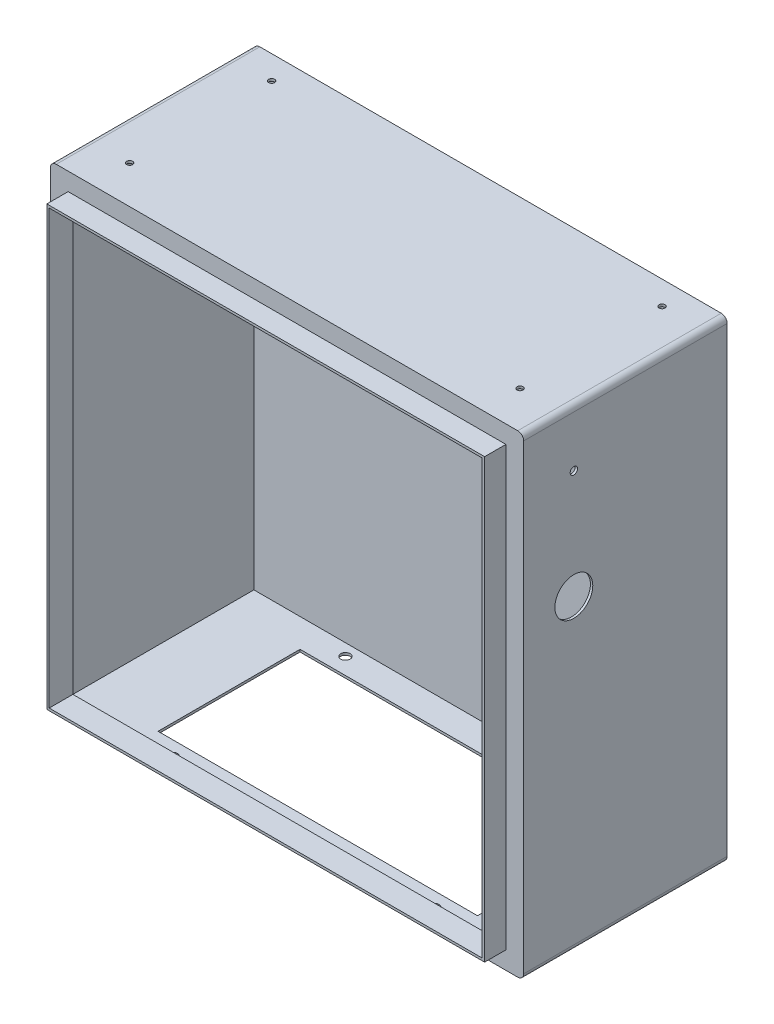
ISO-10303-21;
HEADER;
FILE_DESCRIPTION(('STEP AP214'),'2;1');
FILE_NAME('part.step','',(''),(''),'','','');
FILE_SCHEMA(('AUTOMOTIVE_DESIGN { 1 0 10303 214 1 1 1 1 }'));
ENDSEC;
DATA;
#1=APPLICATION_CONTEXT('core data for automotive mechanical design processes');
#2=APPLICATION_PROTOCOL_DEFINITION('international standard','automotive_design',2000,#1);
#3=PRODUCT_CONTEXT('',#1,'mechanical');
#4=PRODUCT('Part','Part','',(#3));
#5=PRODUCT_RELATED_PRODUCT_CATEGORY('part','',(#4));
#6=PRODUCT_DEFINITION_FORMATION('','',#4);
#7=PRODUCT_DEFINITION_CONTEXT('part definition',#1,'design');
#8=PRODUCT_DEFINITION('design','',#6,#7);
#9=PRODUCT_DEFINITION_SHAPE('','',#8);
#10=(LENGTH_UNIT() NAMED_UNIT(*) SI_UNIT(.MILLI.,.METRE.));
#11=(NAMED_UNIT(*) PLANE_ANGLE_UNIT() SI_UNIT($,.RADIAN.));
#12=(NAMED_UNIT(*) SI_UNIT($,.STERADIAN.) SOLID_ANGLE_UNIT());
#13=UNCERTAINTY_MEASURE_WITH_UNIT(LENGTH_MEASURE(1.E-05),#10,'distance_accuracy_value','');
#14=(GEOMETRIC_REPRESENTATION_CONTEXT(3) GLOBAL_UNCERTAINTY_ASSIGNED_CONTEXT((#13)) GLOBAL_UNIT_ASSIGNED_CONTEXT((#10,
#11,#12)) REPRESENTATION_CONTEXT('',''));
#15=CARTESIAN_POINT('',(0.,0.,0.));
#16=DIRECTION('',(0.,0.,1.));
#17=DIRECTION('',(1.,0.,0.));
#18=AXIS2_PLACEMENT_3D('',#15,#16,#17);
#19=CARTESIAN_POINT('',(0.,0.,170.));
#20=DIRECTION('',(1.,0.,0.));
#21=DIRECTION('',(0.,0.,-1.));
#22=AXIS2_PLACEMENT_3D('',#19,#20,#21);
#23=PLANE('',#22);
#24=DIRECTION('',(0.,-1.,0.));
#25=VECTOR('',#24,1.);
#26=CARTESIAN_POINT('',(0.,400.,172.));
#27=LINE('',#26,#25);
#28=CARTESIAN_POINT('',(0.,395.,172.));
#29=VERTEX_POINT('',#28);
#30=CARTESIAN_POINT('',(0.,5.,172.));
#31=VERTEX_POINT('',#30);
#32=EDGE_CURVE('E342',#29,#31,#27,.T.);
#33=ORIENTED_EDGE('',*,*,#32,.F.);
#34=DIRECTION('',(0.,0.,-1.));
#35=VECTOR('',#34,1.);
#36=CARTESIAN_POINT('',(0.,395.,170.));
#37=LINE('',#36,#35);
#38=CARTESIAN_POINT('',(0.,395.,0.));
#39=VERTEX_POINT('',#38);
#40=EDGE_CURVE('E459',#29,#39,#37,.T.);
#41=ORIENTED_EDGE('',*,*,#40,.T.);
#42=DIRECTION('',(0.,-1.,0.));
#43=VECTOR('',#42,1.);
#44=CARTESIAN_POINT('',(0.,0.,0.));
#45=LINE('',#44,#43);
#46=CARTESIAN_POINT('',(0.,5.,0.));
#47=VERTEX_POINT('',#46);
#48=EDGE_CURVE('E359',#39,#47,#45,.T.);
#49=ORIENTED_EDGE('',*,*,#48,.T.);
#50=DIRECTION('',(0.,0.,-1.));
#51=VECTOR('',#50,1.);
#52=CARTESIAN_POINT('',(0.,5.,170.));
#53=LINE('',#52,#51);
#54=EDGE_CURVE('E456',#47,#31,#53,.F.);
#55=ORIENTED_EDGE('',*,*,#54,.T.);
#56=EDGE_LOOP('',(#33,#41,#49,#55));
#57=FACE_BOUND('',#56,.T.);
#58=ADVANCED_FACE('F48',(#57),#23,.F.);
#59=CARTESIAN_POINT('',(0.,0.,170.));
#60=DIRECTION('',(0.,1.,0.));
#61=DIRECTION('',(0.,0.,1.));
#62=AXIS2_PLACEMENT_3D('',#59,#60,#61);
#63=PLANE('',#62);
#64=CARTESIAN_POINT('',(89.37,0.,12.));
#65=DIRECTION('',(0.,-1.,0.));
#66=DIRECTION('',(0.,0.,-1.));
#67=AXIS2_PLACEMENT_3D('',#64,#65,#66);
#68=CIRCLE('',#67,3.99999999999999);
#69=CARTESIAN_POINT('',(89.37,0.,7.99999999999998));
#70=VERTEX_POINT('',#69);
#71=EDGE_CURVE('E507',#70,#70,#68,.T.);
#72=ORIENTED_EDGE('',*,*,#71,.F.);
#73=EDGE_LOOP('',(#72));
#74=FACE_BOUND('',#73,.T.);
#75=CARTESIAN_POINT('',(310.63,0.,158.));
#76=DIRECTION('',(0.,-1.,0.));
#77=DIRECTION('',(0.,0.,-1.));
#78=AXIS2_PLACEMENT_3D('',#75,#76,#77);
#79=CIRCLE('',#78,3.99999999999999);
#80=CARTESIAN_POINT('',(310.63,0.,154.));
#81=VERTEX_POINT('',#80);
#82=EDGE_CURVE('E514',#81,#81,#79,.T.);
#83=ORIENTED_EDGE('',*,*,#82,.F.);
#84=EDGE_LOOP('',(#83));
#85=FACE_BOUND('',#84,.T.);
#86=CARTESIAN_POINT('',(89.37,0.,158.));
#87=DIRECTION('',(0.,-1.,0.));
#88=DIRECTION('',(0.,0.,-1.));
#89=AXIS2_PLACEMENT_3D('',#86,#87,#88);
#90=CIRCLE('',#89,3.99999999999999);
#91=CARTESIAN_POINT('',(89.37,0.,154.));
#92=VERTEX_POINT('',#91);
#93=EDGE_CURVE('E525',#92,#92,#90,.T.);
#94=ORIENTED_EDGE('',*,*,#93,.F.);
#95=EDGE_LOOP('',(#94));
#96=FACE_BOUND('',#95,.T.);
#97=CARTESIAN_POINT('',(310.63,0.,12.));
#98=DIRECTION('',(0.,-1.,0.));
#99=DIRECTION('',(0.,0.,-1.));
#100=AXIS2_PLACEMENT_3D('',#97,#98,#99);
#101=CIRCLE('',#100,3.99999999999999);
#102=CARTESIAN_POINT('',(310.63,0.,8.00000000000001));
#103=VERTEX_POINT('',#102);
#104=EDGE_CURVE('E492',#103,#103,#101,.T.);
#105=ORIENTED_EDGE('',*,*,#104,.F.);
#106=EDGE_LOOP('',(#105));
#107=FACE_BOUND('',#106,.T.);
#108=DIRECTION('',(1.,0.,0.));
#109=VECTOR('',#108,1.);
#110=CARTESIAN_POINT('',(65.,0.,26.));
#111=LINE('',#110,#109);
#112=CARTESIAN_POINT('',(65.,0.,26.));
#113=VERTEX_POINT('',#112);
#114=CARTESIAN_POINT('',(335.,0.,26.));
#115=VERTEX_POINT('',#114);
#116=EDGE_CURVE('E224',#113,#115,#111,.T.);
#117=ORIENTED_EDGE('',*,*,#116,.F.);
#118=DIRECTION('',(0.,0.,-1.));
#119=VECTOR('',#118,1.);
#120=CARTESIAN_POINT('',(65.,0.,146.));
#121=LINE('',#120,#119);
#122=CARTESIAN_POINT('',(65.,0.,146.));
#123=VERTEX_POINT('',#122);
#124=EDGE_CURVE('E66',#123,#113,#121,.T.);
#125=ORIENTED_EDGE('',*,*,#124,.F.);
#126=DIRECTION('',(-1.,0.,0.));
#127=VECTOR('',#126,1.);
#128=CARTESIAN_POINT('',(65.,0.,146.));
#129=LINE('',#128,#127);
#130=CARTESIAN_POINT('',(335.,0.,146.));
#131=VERTEX_POINT('',#130);
#132=EDGE_CURVE('E232',#131,#123,#129,.T.);
#133=ORIENTED_EDGE('',*,*,#132,.F.);
#134=DIRECTION('',(0.,0.,1.));
#135=VECTOR('',#134,1.);
#136=CARTESIAN_POINT('',(335.,0.,146.));
#137=LINE('',#136,#135);
#138=EDGE_CURVE('E214',#115,#131,#137,.T.);
#139=ORIENTED_EDGE('',*,*,#138,.F.);
#140=EDGE_LOOP('',(#117,#125,#133,#139));
#141=FACE_BOUND('',#140,.T.);
#142=DIRECTION('',(1.,0.,0.));
#143=VECTOR('',#142,1.);
#144=CARTESIAN_POINT('',(0.,0.,0.));
#145=LINE('',#144,#143);
#146=CARTESIAN_POINT('',(5.,0.,0.));
#147=VERTEX_POINT('',#146);
#148=CARTESIAN_POINT('',(395.,0.,0.));
#149=VERTEX_POINT('',#148);
#150=EDGE_CURVE('E399',#147,#149,#145,.T.);
#151=ORIENTED_EDGE('',*,*,#150,.T.);
#152=DIRECTION('',(0.,0.,-1.));
#153=VECTOR('',#152,1.);
#154=CARTESIAN_POINT('',(395.,0.,170.));
#155=LINE('',#154,#153);
#156=CARTESIAN_POINT('',(395.,0.,172.));
#157=VERTEX_POINT('',#156);
#158=EDGE_CURVE('E453',#149,#157,#155,.F.);
#159=ORIENTED_EDGE('',*,*,#158,.T.);
#160=DIRECTION('',(1.,0.,0.));
#161=VECTOR('',#160,1.);
#162=CARTESIAN_POINT('',(0.,0.,172.));
#163=LINE('',#162,#161);
#164=CARTESIAN_POINT('',(5.,0.,172.));
#165=VERTEX_POINT('',#164);
#166=EDGE_CURVE('E346',#165,#157,#163,.T.);
#167=ORIENTED_EDGE('',*,*,#166,.F.);
#168=DIRECTION('',(0.,0.,-1.));
#169=VECTOR('',#168,1.);
#170=CARTESIAN_POINT('',(5.,0.,170.));
#171=LINE('',#170,#169);
#172=EDGE_CURVE('E449',#165,#147,#171,.T.);
#173=ORIENTED_EDGE('',*,*,#172,.T.);
#174=EDGE_LOOP('',(#151,#159,#167,#173));
#175=FACE_BOUND('',#174,.T.);
#176=ADVANCED_FACE('F229',(#74,#85,#96,#107,#141,#175),#63,.F.);
#177=CARTESIAN_POINT('',(400.,0.,170.));
#178=DIRECTION('',(-1.,0.,0.));
#179=DIRECTION('',(0.,0.,1.));
#180=AXIS2_PLACEMENT_3D('',#177,#178,#179);
#181=PLANE('',#180);
#182=CARTESIAN_POINT('',(400.,352.,129.589298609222));
#183=DIRECTION('',(1.,0.,0.));
#184=DIRECTION('',(0.,0.,-1.));
#185=AXIS2_PLACEMENT_3D('',#182,#183,#184);
#186=CIRCLE('',#185,3.09999999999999);
#187=CARTESIAN_POINT('',(400.,352.,126.489298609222));
#188=VERTEX_POINT('',#187);
#189=EDGE_CURVE('E522',#188,#188,#186,.T.);
#190=ORIENTED_EDGE('',*,*,#189,.F.);
#191=EDGE_LOOP('',(#190));
#192=FACE_BOUND('',#191,.T.);
#193=CARTESIAN_POINT('',(400.,260.,129.589298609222));
#194=DIRECTION('',(1.,0.,0.));
#195=DIRECTION('',(0.,0.,-1.));
#196=AXIS2_PLACEMENT_3D('',#193,#194,#195);
#197=CIRCLE('',#196,16.);
#198=CARTESIAN_POINT('',(400.,260.,113.589298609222));
#199=VERTEX_POINT('',#198);
#200=EDGE_CURVE('E508',#199,#199,#197,.T.);
#201=ORIENTED_EDGE('',*,*,#200,.F.);
#202=EDGE_LOOP('',(#201));
#203=FACE_BOUND('',#202,.T.);
#204=DIRECTION('',(0.,1.,0.));
#205=VECTOR('',#204,1.);
#206=CARTESIAN_POINT('',(400.,0.,0.));
#207=LINE('',#206,#205);
#208=CARTESIAN_POINT('',(400.,5.,0.));
#209=VERTEX_POINT('',#208);
#210=CARTESIAN_POINT('',(400.,395.,0.));
#211=VERTEX_POINT('',#210);
#212=EDGE_CURVE('E403',#209,#211,#207,.T.);
#213=ORIENTED_EDGE('',*,*,#212,.T.);
#214=DIRECTION('',(0.,0.,-1.));
#215=VECTOR('',#214,1.);
#216=CARTESIAN_POINT('',(400.,395.,170.));
#217=LINE('',#216,#215);
#218=CARTESIAN_POINT('',(400.,395.,172.));
#219=VERTEX_POINT('',#218);
#220=EDGE_CURVE('E434',#211,#219,#217,.F.);
#221=ORIENTED_EDGE('',*,*,#220,.T.);
#222=DIRECTION('',(0.,1.,0.));
#223=VECTOR('',#222,1.);
#224=CARTESIAN_POINT('',(400.,0.,172.));
#225=LINE('',#224,#223);
#226=CARTESIAN_POINT('',(400.,5.,172.));
#227=VERTEX_POINT('',#226);
#228=EDGE_CURVE('E334',#227,#219,#225,.T.);
#229=ORIENTED_EDGE('',*,*,#228,.F.);
#230=DIRECTION('',(0.,0.,-1.));
#231=VECTOR('',#230,1.);
#232=CARTESIAN_POINT('',(400.,5.,170.));
#233=LINE('',#232,#231);
#234=EDGE_CURVE('E430',#227,#209,#233,.T.);
#235=ORIENTED_EDGE('',*,*,#234,.T.);
#236=EDGE_LOOP('',(#213,#221,#229,#235));
#237=FACE_BOUND('',#236,.T.);
#238=ADVANCED_FACE('F557',(#192,#203,#237),#181,.F.);
#239=CARTESIAN_POINT('',(0.,400.,170.));
#240=DIRECTION('',(0.,-1.,0.));
#241=DIRECTION('',(0.,0.,-1.));
#242=AXIS2_PLACEMENT_3D('',#239,#240,#241);
#243=PLANE('',#242);
#244=CARTESIAN_POINT('',(35.0000000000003,400.,140.));
#245=DIRECTION('',(0.,1.,0.));
#246=DIRECTION('',(0.,0.,1.));
#247=AXIS2_PLACEMENT_3D('',#244,#245,#246);
#248=CIRCLE('',#247,2.5);
#249=CARTESIAN_POINT('',(35.0000000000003,400.,142.5));
#250=VERTEX_POINT('',#249);
#251=EDGE_CURVE('E503',#250,#250,#248,.T.);
#252=ORIENTED_EDGE('',*,*,#251,.F.);
#253=EDGE_LOOP('',(#252));
#254=FACE_BOUND('',#253,.T.);
#255=CARTESIAN_POINT('',(365.,400.,19.9999999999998));
#256=DIRECTION('',(0.,1.,0.));
#257=DIRECTION('',(0.,0.,1.));
#258=AXIS2_PLACEMENT_3D('',#255,#256,#257);
#259=CIRCLE('',#258,2.50000000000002);
#260=CARTESIAN_POINT('',(365.,400.,22.4999999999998));
#261=VERTEX_POINT('',#260);
#262=EDGE_CURVE('E539',#261,#261,#259,.T.);
#263=ORIENTED_EDGE('',*,*,#262,.F.);
#264=EDGE_LOOP('',(#263));
#265=FACE_BOUND('',#264,.T.);
#266=CARTESIAN_POINT('',(365.,400.,140.));
#267=DIRECTION('',(0.,1.,0.));
#268=DIRECTION('',(0.,0.,1.));
#269=AXIS2_PLACEMENT_3D('',#266,#267,#268);
#270=CIRCLE('',#269,2.50000000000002);
#271=CARTESIAN_POINT('',(365.,400.,142.5));
#272=VERTEX_POINT('',#271);
#273=EDGE_CURVE('E535',#272,#272,#270,.T.);
#274=ORIENTED_EDGE('',*,*,#273,.F.);
#275=EDGE_LOOP('',(#274));
#276=FACE_BOUND('',#275,.T.);
#277=CARTESIAN_POINT('',(35.0000000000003,400.,19.9999999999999));
#278=DIRECTION('',(0.,1.,0.));
#279=DIRECTION('',(0.,0.,1.));
#280=AXIS2_PLACEMENT_3D('',#277,#278,#279);
#281=CIRCLE('',#280,2.5);
#282=CARTESIAN_POINT('',(35.0000000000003,400.,22.4999999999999));
#283=VERTEX_POINT('',#282);
#284=EDGE_CURVE('E475',#283,#283,#281,.T.);
#285=ORIENTED_EDGE('',*,*,#284,.F.);
#286=EDGE_LOOP('',(#285));
#287=FACE_BOUND('',#286,.T.);
#288=DIRECTION('',(-1.,0.,0.));
#289=VECTOR('',#288,1.);
#290=CARTESIAN_POINT('',(400.,400.,172.));
#291=LINE('',#290,#289);
#292=CARTESIAN_POINT('',(395.,400.,172.));
#293=VERTEX_POINT('',#292);
#294=CARTESIAN_POINT('',(5.,400.,172.));
#295=VERTEX_POINT('',#294);
#296=EDGE_CURVE('E338',#293,#295,#291,.T.);
#297=ORIENTED_EDGE('',*,*,#296,.F.);
#298=DIRECTION('',(0.,0.,-1.));
#299=VECTOR('',#298,1.);
#300=CARTESIAN_POINT('',(395.,400.,170.));
#301=LINE('',#300,#299);
#302=CARTESIAN_POINT('',(395.,400.,0.));
#303=VERTEX_POINT('',#302);
#304=EDGE_CURVE('E414',#293,#303,#301,.T.);
#305=ORIENTED_EDGE('',*,*,#304,.T.);
#306=DIRECTION('',(-1.,0.,0.));
#307=VECTOR('',#306,1.);
#308=CARTESIAN_POINT('',(0.,400.,0.));
#309=LINE('',#308,#307);
#310=CARTESIAN_POINT('',(5.,400.,0.));
#311=VERTEX_POINT('',#310);
#312=EDGE_CURVE('E407',#303,#311,#309,.T.);
#313=ORIENTED_EDGE('',*,*,#312,.T.);
#314=DIRECTION('',(0.,0.,-1.));
#315=VECTOR('',#314,1.);
#316=CARTESIAN_POINT('',(5.,400.,170.));
#317=LINE('',#316,#315);
#318=EDGE_CURVE('E411',#311,#295,#317,.F.);
#319=ORIENTED_EDGE('',*,*,#318,.T.);
#320=EDGE_LOOP('',(#297,#305,#313,#319));
#321=FACE_BOUND('',#320,.T.);
#322=ADVANCED_FACE('F553',(#254,#265,#276,#287,#321),#243,.F.);
#323=CARTESIAN_POINT('',(0.,0.,0.));
#324=DIRECTION('',(0.,0.,-1.));
#325=DIRECTION('',(-1.,0.,0.));
#326=AXIS2_PLACEMENT_3D('',#323,#324,#325);
#327=PLANE('',#326);
#328=ORIENTED_EDGE('',*,*,#312,.F.);
#329=CARTESIAN_POINT('',(395.,395.,0.));
#330=DIRECTION('',(0.,0.,-1.));
#331=DIRECTION('',(-1.,0.,0.));
#332=AXIS2_PLACEMENT_3D('',#329,#330,#331);
#333=CIRCLE('',#332,5.);
#334=EDGE_CURVE('E427',#303,#211,#333,.T.);
#335=ORIENTED_EDGE('',*,*,#334,.T.);
#336=ORIENTED_EDGE('',*,*,#212,.F.);
#337=CARTESIAN_POINT('',(395.,5.,0.));
#338=DIRECTION('',(0.,0.,-1.));
#339=DIRECTION('',(-1.,0.,0.));
#340=AXIS2_PLACEMENT_3D('',#337,#338,#339);
#341=CIRCLE('',#340,5.);
#342=EDGE_CURVE('E424',#209,#149,#341,.T.);
#343=ORIENTED_EDGE('',*,*,#342,.T.);
#344=ORIENTED_EDGE('',*,*,#150,.F.);
#345=CARTESIAN_POINT('',(5.,5.,0.));
#346=DIRECTION('',(0.,0.,-1.));
#347=DIRECTION('',(-1.,0.,0.));
#348=AXIS2_PLACEMENT_3D('',#345,#346,#347);
#349=CIRCLE('',#348,5.);
#350=EDGE_CURVE('E418',#147,#47,#349,.T.);
#351=ORIENTED_EDGE('',*,*,#350,.T.);
#352=ORIENTED_EDGE('',*,*,#48,.F.);
#353=CARTESIAN_POINT('',(5.,395.,0.));
#354=DIRECTION('',(0.,0.,-1.));
#355=DIRECTION('',(-1.,0.,0.));
#356=AXIS2_PLACEMENT_3D('',#353,#354,#355);
#357=CIRCLE('',#356,5.);
#358=EDGE_CURVE('E421',#39,#311,#357,.T.);
#359=ORIENTED_EDGE('',*,*,#358,.T.);
#360=EDGE_LOOP('',(#328,#335,#336,#343,#344,#351,#352,#359));
#361=FACE_BOUND('',#360,.T.);
#362=ADVANCED_FACE('F556',(#361),#327,.T.);
#363=CARTESIAN_POINT('',(0.,0.,172.));
#364=DIRECTION('',(0.,0.,1.));
#365=DIRECTION('',(1.,0.,0.));
#366=AXIS2_PLACEMENT_3D('',#363,#364,#365);
#367=PLANE('',#366);
#368=ORIENTED_EDGE('',*,*,#228,.T.);
#369=CARTESIAN_POINT('',(395.,395.,172.));
#370=DIRECTION('',(0.,0.,1.));
#371=DIRECTION('',(1.,0.,0.));
#372=AXIS2_PLACEMENT_3D('',#369,#370,#371);
#373=CIRCLE('',#372,5.);
#374=EDGE_CURVE('E446',#219,#293,#373,.T.);
#375=ORIENTED_EDGE('',*,*,#374,.T.);
#376=ORIENTED_EDGE('',*,*,#296,.T.);
#377=CARTESIAN_POINT('',(5.,395.,172.));
#378=DIRECTION('',(0.,0.,1.));
#379=DIRECTION('',(1.,0.,0.));
#380=AXIS2_PLACEMENT_3D('',#377,#378,#379);
#381=CIRCLE('',#380,5.);
#382=EDGE_CURVE('E440',#295,#29,#381,.T.);
#383=ORIENTED_EDGE('',*,*,#382,.T.);
#384=ORIENTED_EDGE('',*,*,#32,.T.);
#385=CARTESIAN_POINT('',(5.,5.,172.));
#386=DIRECTION('',(0.,0.,1.));
#387=DIRECTION('',(1.,0.,0.));
#388=AXIS2_PLACEMENT_3D('',#385,#386,#387);
#389=CIRCLE('',#388,5.);
#390=EDGE_CURVE('E437',#31,#165,#389,.T.);
#391=ORIENTED_EDGE('',*,*,#390,.T.);
#392=ORIENTED_EDGE('',*,*,#166,.T.);
#393=CARTESIAN_POINT('',(395.,5.,172.));
#394=DIRECTION('',(0.,0.,1.));
#395=DIRECTION('',(1.,0.,0.));
#396=AXIS2_PLACEMENT_3D('',#393,#394,#395);
#397=CIRCLE('',#396,5.);
#398=EDGE_CURVE('E443',#157,#227,#397,.T.);
#399=ORIENTED_EDGE('',*,*,#398,.T.);
#400=EDGE_LOOP('',(#368,#375,#376,#383,#384,#391,#392,#399));
#401=FACE_BOUND('',#400,.T.);
#402=DIRECTION('',(1.,0.,0.));
#403=VECTOR('',#402,1.);
#404=CARTESIAN_POINT('',(15.,15.,172.));
#405=LINE('',#404,#403);
#406=CARTESIAN_POINT('',(15.,15.,172.));
#407=VERTEX_POINT('',#406);
#408=CARTESIAN_POINT('',(385.,15.,172.));
#409=VERTEX_POINT('',#408);
#410=EDGE_CURVE('E322',#407,#409,#405,.T.);
#411=ORIENTED_EDGE('',*,*,#410,.F.);
#412=DIRECTION('',(0.,-1.,0.));
#413=VECTOR('',#412,1.);
#414=CARTESIAN_POINT('',(15.,385.,172.));
#415=LINE('',#414,#413);
#416=CARTESIAN_POINT('',(15.,385.,172.));
#417=VERTEX_POINT('',#416);
#418=EDGE_CURVE('E310',#417,#407,#415,.T.);
#419=ORIENTED_EDGE('',*,*,#418,.F.);
#420=DIRECTION('',(-1.,0.,0.));
#421=VECTOR('',#420,1.);
#422=CARTESIAN_POINT('',(15.,385.,172.));
#423=LINE('',#422,#421);
#424=CARTESIAN_POINT('',(385.,385.,172.));
#425=VERTEX_POINT('',#424);
#426=EDGE_CURVE('E330',#425,#417,#423,.T.);
#427=ORIENTED_EDGE('',*,*,#426,.F.);
#428=DIRECTION('',(0.,1.,0.));
#429=VECTOR('',#428,1.);
#430=CARTESIAN_POINT('',(385.,385.,172.));
#431=LINE('',#430,#429);
#432=EDGE_CURVE('E326',#409,#425,#431,.T.);
#433=ORIENTED_EDGE('',*,*,#432,.F.);
#434=EDGE_LOOP('',(#411,#419,#427,#433));
#435=FACE_BOUND('',#434,.T.);
#436=ADVANCED_FACE('F591',(#401,#435),#367,.T.);
#437=CARTESIAN_POINT('',(15.,385.,170.));
#438=DIRECTION('',(-1.,0.,0.));
#439=DIRECTION('',(0.,-1.,0.));
#440=AXIS2_PLACEMENT_3D('',#437,#438,#439);
#441=PLANE('',#440);
#442=DIRECTION('',(0.,0.,1.));
#443=VECTOR('',#442,1.);
#444=CARTESIAN_POINT('',(15.,385.,170.));
#445=LINE('',#444,#443);
#446=CARTESIAN_POINT('',(15.,385.,190.));
#447=VERTEX_POINT('',#446);
#448=EDGE_CURVE('E307',#417,#447,#445,.T.);
#449=ORIENTED_EDGE('',*,*,#448,.F.);
#450=ORIENTED_EDGE('',*,*,#418,.T.);
#451=DIRECTION('',(0.,0.,1.));
#452=VECTOR('',#451,1.);
#453=CARTESIAN_POINT('',(15.,15.,170.));
#454=LINE('',#453,#452);
#455=CARTESIAN_POINT('',(15.,15.,190.));
#456=VERTEX_POINT('',#455);
#457=EDGE_CURVE('E298',#407,#456,#454,.T.);
#458=ORIENTED_EDGE('',*,*,#457,.T.);
#459=DIRECTION('',(0.,-1.,0.));
#460=VECTOR('',#459,1.);
#461=CARTESIAN_POINT('',(15.,385.,190.));
#462=LINE('',#461,#460);
#463=EDGE_CURVE('E262',#447,#456,#462,.T.);
#464=ORIENTED_EDGE('',*,*,#463,.F.);
#465=EDGE_LOOP('',(#449,#450,#458,#464));
#466=FACE_BOUND('',#465,.T.);
#467=ADVANCED_FACE('F594',(#466),#441,.T.);
#468=CARTESIAN_POINT('',(385.,385.,170.));
#469=DIRECTION('',(0.,1.,0.));
#470=DIRECTION('',(0.,0.,1.));
#471=AXIS2_PLACEMENT_3D('',#468,#469,#470);
#472=PLANE('',#471);
#473=DIRECTION('',(0.,0.,1.));
#474=VECTOR('',#473,1.);
#475=CARTESIAN_POINT('',(385.,385.,170.));
#476=LINE('',#475,#474);
#477=CARTESIAN_POINT('',(385.,385.,190.));
#478=VERTEX_POINT('',#477);
#479=EDGE_CURVE('E311',#425,#478,#476,.T.);
#480=ORIENTED_EDGE('',*,*,#479,.F.);
#481=ORIENTED_EDGE('',*,*,#426,.T.);
#482=ORIENTED_EDGE('',*,*,#448,.T.);
#483=DIRECTION('',(-1.,0.,0.));
#484=VECTOR('',#483,1.);
#485=CARTESIAN_POINT('',(385.,385.,190.));
#486=LINE('',#485,#484);
#487=EDGE_CURVE('E274',#478,#447,#486,.T.);
#488=ORIENTED_EDGE('',*,*,#487,.F.);
#489=EDGE_LOOP('',(#480,#481,#482,#488));
#490=FACE_BOUND('',#489,.T.);
#491=ADVANCED_FACE('F611',(#490),#472,.T.);
#492=CARTESIAN_POINT('',(385.,15.,170.));
#493=DIRECTION('',(1.,0.,0.));
#494=DIRECTION('',(0.,1.,0.));
#495=AXIS2_PLACEMENT_3D('',#492,#493,#494);
#496=PLANE('',#495);
#497=DIRECTION('',(0.,0.,1.));
#498=VECTOR('',#497,1.);
#499=CARTESIAN_POINT('',(385.,15.,170.));
#500=LINE('',#499,#498);
#501=CARTESIAN_POINT('',(385.,15.,190.));
#502=VERTEX_POINT('',#501);
#503=EDGE_CURVE('E314',#409,#502,#500,.T.);
#504=ORIENTED_EDGE('',*,*,#503,.F.);
#505=ORIENTED_EDGE('',*,*,#432,.T.);
#506=ORIENTED_EDGE('',*,*,#479,.T.);
#507=DIRECTION('',(0.,1.,0.));
#508=VECTOR('',#507,1.);
#509=CARTESIAN_POINT('',(385.,15.,190.));
#510=LINE('',#509,#508);
#511=EDGE_CURVE('E270',#502,#478,#510,.T.);
#512=ORIENTED_EDGE('',*,*,#511,.F.);
#513=EDGE_LOOP('',(#504,#505,#506,#512));
#514=FACE_BOUND('',#513,.T.);
#515=ADVANCED_FACE('F613',(#514),#496,.T.);
#516=CARTESIAN_POINT('',(15.,15.,170.));
#517=DIRECTION('',(0.,-1.,0.));
#518=DIRECTION('',(0.,0.,-1.));
#519=AXIS2_PLACEMENT_3D('',#516,#517,#518);
#520=PLANE('',#519);
#521=ORIENTED_EDGE('',*,*,#457,.F.);
#522=ORIENTED_EDGE('',*,*,#410,.T.);
#523=ORIENTED_EDGE('',*,*,#503,.T.);
#524=DIRECTION('',(1.,0.,0.));
#525=VECTOR('',#524,1.);
#526=CARTESIAN_POINT('',(15.,15.,190.));
#527=LINE('',#526,#525);
#528=EDGE_CURVE('E266',#456,#502,#527,.T.);
#529=ORIENTED_EDGE('',*,*,#528,.F.);
#530=EDGE_LOOP('',(#521,#522,#523,#529));
#531=FACE_BOUND('',#530,.T.);
#532=ADVANCED_FACE('F603',(#531),#520,.T.);
#533=CARTESIAN_POINT('',(17.,383.,170.));
#534=DIRECTION('',(-1.,0.,0.));
#535=DIRECTION('',(0.,-1.,0.));
#536=AXIS2_PLACEMENT_3D('',#533,#534,#535);
#537=PLANE('',#536);
#538=DIRECTION('',(0.,0.,1.));
#539=VECTOR('',#538,1.);
#540=CARTESIAN_POINT('',(17.,383.,170.));
#541=LINE('',#540,#539);
#542=CARTESIAN_POINT('',(17.,383.,170.));
#543=VERTEX_POINT('',#542);
#544=CARTESIAN_POINT('',(17.,383.,190.));
#545=VERTEX_POINT('',#544);
#546=EDGE_CURVE('E295',#543,#545,#541,.T.);
#547=ORIENTED_EDGE('',*,*,#546,.T.);
#548=DIRECTION('',(0.,-1.,0.));
#549=VECTOR('',#548,1.);
#550=CARTESIAN_POINT('',(17.,383.,190.));
#551=LINE('',#550,#549);
#552=CARTESIAN_POINT('',(17.,17.,190.));
#553=VERTEX_POINT('',#552);
#554=EDGE_CURVE('E242',#545,#553,#551,.T.);
#555=ORIENTED_EDGE('',*,*,#554,.T.);
#556=DIRECTION('',(0.,0.,1.));
#557=VECTOR('',#556,1.);
#558=CARTESIAN_POINT('',(17.,17.,170.));
#559=LINE('',#558,#557);
#560=CARTESIAN_POINT('',(17.,17.,170.));
#561=VERTEX_POINT('',#560);
#562=EDGE_CURVE('E294',#561,#553,#559,.T.);
#563=ORIENTED_EDGE('',*,*,#562,.F.);
#564=DIRECTION('',(0.,-1.,0.));
#565=VECTOR('',#564,1.);
#566=CARTESIAN_POINT('',(17.,383.,170.));
#567=LINE('',#566,#565);
#568=EDGE_CURVE('E278',#543,#561,#567,.T.);
#569=ORIENTED_EDGE('',*,*,#568,.F.);
#570=EDGE_LOOP('',(#547,#555,#563,#569));
#571=FACE_BOUND('',#570,.T.);
#572=ADVANCED_FACE('F620',(#571),#537,.F.);
#573=CARTESIAN_POINT('',(17.,383.,170.));
#574=DIRECTION('',(0.,1.,0.));
#575=DIRECTION('',(0.,0.,1.));
#576=AXIS2_PLACEMENT_3D('',#573,#574,#575);
#577=PLANE('',#576);
#578=DIRECTION('',(0.,0.,1.));
#579=VECTOR('',#578,1.);
#580=CARTESIAN_POINT('',(383.,383.,170.));
#581=LINE('',#580,#579);
#582=CARTESIAN_POINT('',(383.,383.,170.));
#583=VERTEX_POINT('',#582);
#584=CARTESIAN_POINT('',(383.,383.,190.));
#585=VERTEX_POINT('',#584);
#586=EDGE_CURVE('E299',#583,#585,#581,.T.);
#587=ORIENTED_EDGE('',*,*,#586,.T.);
#588=DIRECTION('',(-1.,0.,0.));
#589=VECTOR('',#588,1.);
#590=CARTESIAN_POINT('',(17.,383.,190.));
#591=LINE('',#590,#589);
#592=EDGE_CURVE('E258',#585,#545,#591,.T.);
#593=ORIENTED_EDGE('',*,*,#592,.T.);
#594=ORIENTED_EDGE('',*,*,#546,.F.);
#595=DIRECTION('',(-1.,0.,0.));
#596=VECTOR('',#595,1.);
#597=CARTESIAN_POINT('',(17.,383.,170.));
#598=LINE('',#597,#596);
#599=EDGE_CURVE('E290',#583,#543,#598,.T.);
#600=ORIENTED_EDGE('',*,*,#599,.F.);
#601=EDGE_LOOP('',(#587,#593,#594,#600));
#602=FACE_BOUND('',#601,.T.);
#603=ADVANCED_FACE('F658',(#602),#577,.F.);
#604=CARTESIAN_POINT('',(383.,383.,170.));
#605=DIRECTION('',(1.,0.,0.));
#606=DIRECTION('',(0.,1.,0.));
#607=AXIS2_PLACEMENT_3D('',#604,#605,#606);
#608=PLANE('',#607);
#609=DIRECTION('',(0.,0.,1.));
#610=VECTOR('',#609,1.);
#611=CARTESIAN_POINT('',(383.,17.,170.));
#612=LINE('',#611,#610);
#613=CARTESIAN_POINT('',(383.,17.,170.));
#614=VERTEX_POINT('',#613);
#615=CARTESIAN_POINT('',(383.,17.,190.));
#616=VERTEX_POINT('',#615);
#617=EDGE_CURVE('E302',#614,#616,#612,.T.);
#618=ORIENTED_EDGE('',*,*,#617,.T.);
#619=DIRECTION('',(0.,1.,0.));
#620=VECTOR('',#619,1.);
#621=CARTESIAN_POINT('',(383.,383.,190.));
#622=LINE('',#621,#620);
#623=EDGE_CURVE('E254',#616,#585,#622,.T.);
#624=ORIENTED_EDGE('',*,*,#623,.T.);
#625=ORIENTED_EDGE('',*,*,#586,.F.);
#626=DIRECTION('',(0.,1.,0.));
#627=VECTOR('',#626,1.);
#628=CARTESIAN_POINT('',(383.,383.,170.));
#629=LINE('',#628,#627);
#630=EDGE_CURVE('E286',#614,#583,#629,.T.);
#631=ORIENTED_EDGE('',*,*,#630,.F.);
#632=EDGE_LOOP('',(#618,#624,#625,#631));
#633=FACE_BOUND('',#632,.T.);
#634=ADVANCED_FACE('F661',(#633),#608,.F.);
#635=CARTESIAN_POINT('',(17.,17.,170.));
#636=DIRECTION('',(0.,-1.,0.));
#637=DIRECTION('',(0.,0.,-1.));
#638=AXIS2_PLACEMENT_3D('',#635,#636,#637);
#639=PLANE('',#638);
#640=ORIENTED_EDGE('',*,*,#562,.T.);
#641=DIRECTION('',(1.,0.,0.));
#642=VECTOR('',#641,1.);
#643=CARTESIAN_POINT('',(17.,17.,190.));
#644=LINE('',#643,#642);
#645=EDGE_CURVE('E250',#553,#616,#644,.T.);
#646=ORIENTED_EDGE('',*,*,#645,.T.);
#647=ORIENTED_EDGE('',*,*,#617,.F.);
#648=DIRECTION('',(1.,0.,0.));
#649=VECTOR('',#648,1.);
#650=CARTESIAN_POINT('',(17.,17.,170.));
#651=LINE('',#650,#649);
#652=EDGE_CURVE('E282',#561,#614,#651,.T.);
#653=ORIENTED_EDGE('',*,*,#652,.F.);
#654=EDGE_LOOP('',(#640,#646,#647,#653));
#655=FACE_BOUND('',#654,.T.);
#656=ADVANCED_FACE('F657',(#655),#639,.F.);
#657=CARTESIAN_POINT('',(0.,0.,190.));
#658=DIRECTION('',(0.,0.,1.));
#659=DIRECTION('',(1.,0.,0.));
#660=AXIS2_PLACEMENT_3D('',#657,#658,#659);
#661=PLANE('',#660);
#662=ORIENTED_EDGE('',*,*,#463,.T.);
#663=ORIENTED_EDGE('',*,*,#528,.T.);
#664=ORIENTED_EDGE('',*,*,#511,.T.);
#665=ORIENTED_EDGE('',*,*,#487,.T.);
#666=EDGE_LOOP('',(#662,#663,#664,#665));
#667=FACE_BOUND('',#666,.T.);
#668=ORIENTED_EDGE('',*,*,#645,.F.);
#669=ORIENTED_EDGE('',*,*,#554,.F.);
#670=ORIENTED_EDGE('',*,*,#592,.F.);
#671=ORIENTED_EDGE('',*,*,#623,.F.);
#672=EDGE_LOOP('',(#668,#669,#670,#671));
#673=FACE_BOUND('',#672,.T.);
#674=ADVANCED_FACE('F606',(#667,#673),#661,.T.);
#675=CARTESIAN_POINT('',(0.,0.,2.));
#676=DIRECTION('',(0.,0.,-1.));
#677=DIRECTION('',(-1.,0.,0.));
#678=AXIS2_PLACEMENT_3D('',#675,#676,#677);
#679=PLANE('',#678);
#680=DIRECTION('',(0.,-1.,0.));
#681=VECTOR('',#680,1.);
#682=CARTESIAN_POINT('',(2.,0.,2.));
#683=LINE('',#682,#681);
#684=CARTESIAN_POINT('',(2.,398.,2.));
#685=VERTEX_POINT('',#684);
#686=CARTESIAN_POINT('',(2.,2.,2.));
#687=VERTEX_POINT('',#686);
#688=EDGE_CURVE('E350',#685,#687,#683,.T.);
#689=ORIENTED_EDGE('',*,*,#688,.T.);
#690=DIRECTION('',(1.,0.,0.));
#691=VECTOR('',#690,1.);
#692=CARTESIAN_POINT('',(0.,2.,2.));
#693=LINE('',#692,#691);
#694=CARTESIAN_POINT('',(398.,2.,2.));
#695=VERTEX_POINT('',#694);
#696=EDGE_CURVE('E354',#687,#695,#693,.T.);
#697=ORIENTED_EDGE('',*,*,#696,.T.);
#698=DIRECTION('',(0.,1.,0.));
#699=VECTOR('',#698,1.);
#700=CARTESIAN_POINT('',(398.,0.,2.));
#701=LINE('',#700,#699);
#702=CARTESIAN_POINT('',(398.,398.,2.));
#703=VERTEX_POINT('',#702);
#704=EDGE_CURVE('E369',#695,#703,#701,.T.);
#705=ORIENTED_EDGE('',*,*,#704,.T.);
#706=DIRECTION('',(-1.,0.,0.));
#707=VECTOR('',#706,1.);
#708=CARTESIAN_POINT('',(0.,398.,2.));
#709=LINE('',#708,#707);
#710=EDGE_CURVE('E375',#703,#685,#709,.T.);
#711=ORIENTED_EDGE('',*,*,#710,.T.);
#712=EDGE_LOOP('',(#689,#697,#705,#711));
#713=FACE_BOUND('',#712,.T.);
#714=ADVANCED_FACE('F656',(#713),#679,.F.);
#715=CARTESIAN_POINT('',(0.,2.,170.));
#716=DIRECTION('',(0.,1.,0.));
#717=DIRECTION('',(0.,0.,1.));
#718=AXIS2_PLACEMENT_3D('',#715,#716,#717);
#719=PLANE('',#718);
#720=CARTESIAN_POINT('',(89.37,2.,12.));
#721=DIRECTION('',(0.,1.,0.));
#722=DIRECTION('',(0.,0.,1.));
#723=AXIS2_PLACEMENT_3D('',#720,#721,#722);
#724=CIRCLE('',#723,3.99999999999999);
#725=CARTESIAN_POINT('',(89.37,2.,16.));
#726=VERTEX_POINT('',#725);
#727=EDGE_CURVE('E500',#726,#726,#724,.T.);
#728=ORIENTED_EDGE('',*,*,#727,.F.);
#729=EDGE_LOOP('',(#728));
#730=FACE_BOUND('',#729,.T.);
#731=CARTESIAN_POINT('',(310.63,2.,158.));
#732=DIRECTION('',(0.,1.,0.));
#733=DIRECTION('',(0.,0.,1.));
#734=AXIS2_PLACEMENT_3D('',#731,#732,#733);
#735=CIRCLE('',#734,3.99999999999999);
#736=CARTESIAN_POINT('',(310.63,2.,162.));
#737=VERTEX_POINT('',#736);
#738=EDGE_CURVE('E496',#737,#737,#735,.T.);
#739=ORIENTED_EDGE('',*,*,#738,.F.);
#740=EDGE_LOOP('',(#739));
#741=FACE_BOUND('',#740,.T.);
#742=CARTESIAN_POINT('',(89.37,2.,158.));
#743=DIRECTION('',(0.,1.,0.));
#744=DIRECTION('',(0.,0.,1.));
#745=AXIS2_PLACEMENT_3D('',#742,#743,#744);
#746=CIRCLE('',#745,3.99999999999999);
#747=CARTESIAN_POINT('',(89.37,2.,162.));
#748=VERTEX_POINT('',#747);
#749=EDGE_CURVE('E491',#748,#748,#746,.T.);
#750=ORIENTED_EDGE('',*,*,#749,.F.);
#751=EDGE_LOOP('',(#750));
#752=FACE_BOUND('',#751,.T.);
#753=CARTESIAN_POINT('',(310.63,2.,12.));
#754=DIRECTION('',(0.,1.,0.));
#755=DIRECTION('',(0.,0.,1.));
#756=AXIS2_PLACEMENT_3D('',#753,#754,#755);
#757=CIRCLE('',#756,3.99999999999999);
#758=CARTESIAN_POINT('',(310.63,2.,16.));
#759=VERTEX_POINT('',#758);
#760=EDGE_CURVE('E487',#759,#759,#757,.T.);
#761=ORIENTED_EDGE('',*,*,#760,.F.);
#762=EDGE_LOOP('',(#761));
#763=FACE_BOUND('',#762,.T.);
#764=DIRECTION('',(0.,0.,1.));
#765=VECTOR('',#764,1.);
#766=CARTESIAN_POINT('',(65.,2.,170.));
#767=LINE('',#766,#765);
#768=CARTESIAN_POINT('',(65.,2.,26.));
#769=VERTEX_POINT('',#768);
#770=CARTESIAN_POINT('',(65.,2.,146.));
#771=VERTEX_POINT('',#770);
#772=EDGE_CURVE('E11',#769,#771,#767,.T.);
#773=ORIENTED_EDGE('',*,*,#772,.F.);
#774=DIRECTION('',(-1.,0.,0.));
#775=VECTOR('',#774,1.);
#776=CARTESIAN_POINT('',(0.,2.,26.));
#777=LINE('',#776,#775);
#778=CARTESIAN_POINT('',(335.,2.,26.));
#779=VERTEX_POINT('',#778);
#780=EDGE_CURVE('E463',#779,#769,#777,.T.);
#781=ORIENTED_EDGE('',*,*,#780,.F.);
#782=DIRECTION('',(0.,0.,-1.));
#783=VECTOR('',#782,1.);
#784=CARTESIAN_POINT('',(335.,2.,170.));
#785=LINE('',#784,#783);
#786=CARTESIAN_POINT('',(335.,2.,146.));
#787=VERTEX_POINT('',#786);
#788=EDGE_CURVE('E217',#787,#779,#785,.T.);
#789=ORIENTED_EDGE('',*,*,#788,.F.);
#790=DIRECTION('',(1.,0.,0.));
#791=VECTOR('',#790,1.);
#792=CARTESIAN_POINT('',(0.,2.,146.));
#793=LINE('',#792,#791);
#794=EDGE_CURVE('E58',#771,#787,#793,.T.);
#795=ORIENTED_EDGE('',*,*,#794,.F.);
#796=EDGE_LOOP('',(#773,#781,#789,#795));
#797=FACE_BOUND('',#796,.T.);
#798=ORIENTED_EDGE('',*,*,#696,.F.);
#799=DIRECTION('',(0.,0.,-1.));
#800=VECTOR('',#799,1.);
#801=CARTESIAN_POINT('',(2.,2.,170.));
#802=LINE('',#801,#800);
#803=CARTESIAN_POINT('',(2.,2.,170.));
#804=VERTEX_POINT('',#803);
#805=EDGE_CURVE('E355',#804,#687,#802,.T.);
#806=ORIENTED_EDGE('',*,*,#805,.F.);
#807=DIRECTION('',(1.,0.,0.));
#808=VECTOR('',#807,1.);
#809=CARTESIAN_POINT('',(0.,2.,170.));
#810=LINE('',#809,#808);
#811=CARTESIAN_POINT('',(398.,2.,170.));
#812=VERTEX_POINT('',#811);
#813=EDGE_CURVE('E385',#804,#812,#810,.T.);
#814=ORIENTED_EDGE('',*,*,#813,.T.);
#815=DIRECTION('',(0.,0.,-1.));
#816=VECTOR('',#815,1.);
#817=CARTESIAN_POINT('',(398.,2.,170.));
#818=LINE('',#817,#816);
#819=EDGE_CURVE('E360',#812,#695,#818,.T.);
#820=ORIENTED_EDGE('',*,*,#819,.T.);
#821=EDGE_LOOP('',(#798,#806,#814,#820));
#822=FACE_BOUND('',#821,.T.);
#823=ADVANCED_FACE('F694',(#730,#741,#752,#763,#797,#822),#719,.T.);
#824=CARTESIAN_POINT('',(398.,0.,170.));
#825=DIRECTION('',(-1.,0.,0.));
#826=DIRECTION('',(0.,0.,1.));
#827=AXIS2_PLACEMENT_3D('',#824,#825,#826);
#828=PLANE('',#827);
#829=CARTESIAN_POINT('',(398.,352.,129.589298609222));
#830=DIRECTION('',(-1.,0.,0.));
#831=DIRECTION('',(0.,0.,1.));
#832=AXIS2_PLACEMENT_3D('',#829,#830,#831);
#833=CIRCLE('',#832,3.09999999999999);
#834=CARTESIAN_POINT('',(398.,352.,132.689298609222));
#835=VERTEX_POINT('',#834);
#836=EDGE_CURVE('E52',#835,#835,#833,.T.);
#837=ORIENTED_EDGE('',*,*,#836,.F.);
#838=EDGE_LOOP('',(#837));
#839=FACE_BOUND('',#838,.T.);
#840=CARTESIAN_POINT('',(398.,260.,129.589298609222));
#841=DIRECTION('',(-1.,0.,0.));
#842=DIRECTION('',(0.,0.,1.));
#843=AXIS2_PLACEMENT_3D('',#840,#841,#842);
#844=CIRCLE('',#843,16.);
#845=CARTESIAN_POINT('',(398.,260.,145.589298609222));
#846=VERTEX_POINT('',#845);
#847=EDGE_CURVE('E504',#846,#846,#844,.T.);
#848=ORIENTED_EDGE('',*,*,#847,.F.);
#849=EDGE_LOOP('',(#848));
#850=FACE_BOUND('',#849,.T.);
#851=ORIENTED_EDGE('',*,*,#704,.F.);
#852=ORIENTED_EDGE('',*,*,#819,.F.);
#853=DIRECTION('',(0.,1.,0.));
#854=VECTOR('',#853,1.);
#855=CARTESIAN_POINT('',(398.,0.,170.));
#856=LINE('',#855,#854);
#857=CARTESIAN_POINT('',(398.,398.,170.));
#858=VERTEX_POINT('',#857);
#859=EDGE_CURVE('E389',#812,#858,#856,.T.);
#860=ORIENTED_EDGE('',*,*,#859,.T.);
#861=DIRECTION('',(0.,0.,-1.));
#862=VECTOR('',#861,1.);
#863=CARTESIAN_POINT('',(398.,398.,170.));
#864=LINE('',#863,#862);
#865=EDGE_CURVE('E365',#858,#703,#864,.T.);
#866=ORIENTED_EDGE('',*,*,#865,.T.);
#867=EDGE_LOOP('',(#851,#852,#860,#866));
#868=FACE_BOUND('',#867,.T.);
#869=ADVANCED_FACE('F697',(#839,#850,#868),#828,.T.);
#870=CARTESIAN_POINT('',(0.,398.,170.));
#871=DIRECTION('',(0.,-1.,0.));
#872=DIRECTION('',(0.,0.,-1.));
#873=AXIS2_PLACEMENT_3D('',#870,#871,#872);
#874=PLANE('',#873);
#875=CARTESIAN_POINT('',(35.0000000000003,398.,140.));
#876=DIRECTION('',(0.,-1.,0.));
#877=DIRECTION('',(0.,0.,-1.));
#878=AXIS2_PLACEMENT_3D('',#875,#876,#877);
#879=CIRCLE('',#878,2.5);
#880=CARTESIAN_POINT('',(35.0000000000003,398.,137.5));
#881=VERTEX_POINT('',#880);
#882=EDGE_CURVE('E483',#881,#881,#879,.T.);
#883=ORIENTED_EDGE('',*,*,#882,.F.);
#884=EDGE_LOOP('',(#883));
#885=FACE_BOUND('',#884,.T.);
#886=CARTESIAN_POINT('',(365.,398.,19.9999999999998));
#887=DIRECTION('',(0.,-1.,0.));
#888=DIRECTION('',(0.,0.,-1.));
#889=AXIS2_PLACEMENT_3D('',#886,#887,#888);
#890=CIRCLE('',#889,2.50000000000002);
#891=CARTESIAN_POINT('',(365.,398.,17.4999999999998));
#892=VERTEX_POINT('',#891);
#893=EDGE_CURVE('E479',#892,#892,#890,.T.);
#894=ORIENTED_EDGE('',*,*,#893,.F.);
#895=EDGE_LOOP('',(#894));
#896=FACE_BOUND('',#895,.T.);
#897=CARTESIAN_POINT('',(365.,398.,140.));
#898=DIRECTION('',(0.,-1.,0.));
#899=DIRECTION('',(0.,0.,-1.));
#900=AXIS2_PLACEMENT_3D('',#897,#898,#899);
#901=CIRCLE('',#900,2.50000000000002);
#902=CARTESIAN_POINT('',(365.,398.,137.5));
#903=VERTEX_POINT('',#902);
#904=EDGE_CURVE('E474',#903,#903,#901,.T.);
#905=ORIENTED_EDGE('',*,*,#904,.F.);
#906=EDGE_LOOP('',(#905));
#907=FACE_BOUND('',#906,.T.);
#908=CARTESIAN_POINT('',(35.0000000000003,398.,19.9999999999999));
#909=DIRECTION('',(0.,-1.,0.));
#910=DIRECTION('',(0.,0.,-1.));
#911=AXIS2_PLACEMENT_3D('',#908,#909,#910);
#912=CIRCLE('',#911,2.5);
#913=CARTESIAN_POINT('',(35.0000000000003,398.,17.4999999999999));
#914=VERTEX_POINT('',#913);
#915=EDGE_CURVE('E470',#914,#914,#912,.T.);
#916=ORIENTED_EDGE('',*,*,#915,.F.);
#917=EDGE_LOOP('',(#916));
#918=FACE_BOUND('',#917,.T.);
#919=ORIENTED_EDGE('',*,*,#710,.F.);
#920=ORIENTED_EDGE('',*,*,#865,.F.);
#921=DIRECTION('',(-1.,0.,0.));
#922=VECTOR('',#921,1.);
#923=CARTESIAN_POINT('',(0.,398.,170.));
#924=LINE('',#923,#922);
#925=CARTESIAN_POINT('',(2.,398.,170.));
#926=VERTEX_POINT('',#925);
#927=EDGE_CURVE('E366',#858,#926,#924,.T.);
#928=ORIENTED_EDGE('',*,*,#927,.T.);
#929=DIRECTION('',(0.,0.,-1.));
#930=VECTOR('',#929,1.);
#931=CARTESIAN_POINT('',(2.,398.,170.));
#932=LINE('',#931,#930);
#933=EDGE_CURVE('E361',#926,#685,#932,.T.);
#934=ORIENTED_EDGE('',*,*,#933,.T.);
#935=EDGE_LOOP('',(#919,#920,#928,#934));
#936=FACE_BOUND('',#935,.T.);
#937=ADVANCED_FACE('F689',(#885,#896,#907,#918,#936),#874,.T.);
#938=CARTESIAN_POINT('',(2.,0.,170.));
#939=DIRECTION('',(1.,0.,0.));
#940=DIRECTION('',(0.,0.,-1.));
#941=AXIS2_PLACEMENT_3D('',#938,#939,#940);
#942=PLANE('',#941);
#943=ORIENTED_EDGE('',*,*,#688,.F.);
#944=ORIENTED_EDGE('',*,*,#933,.F.);
#945=DIRECTION('',(0.,-1.,0.));
#946=VECTOR('',#945,1.);
#947=CARTESIAN_POINT('',(2.,0.,170.));
#948=LINE('',#947,#946);
#949=EDGE_CURVE('E381',#926,#804,#948,.T.);
#950=ORIENTED_EDGE('',*,*,#949,.T.);
#951=ORIENTED_EDGE('',*,*,#805,.T.);
#952=EDGE_LOOP('',(#943,#944,#950,#951));
#953=FACE_BOUND('',#952,.T.);
#954=ADVANCED_FACE('F683',(#953),#942,.T.);
#955=CARTESIAN_POINT('',(0.,0.,170.));
#956=DIRECTION('',(0.,0.,1.));
#957=DIRECTION('',(1.,0.,0.));
#958=AXIS2_PLACEMENT_3D('',#955,#956,#957);
#959=PLANE('',#958);
#960=ORIENTED_EDGE('',*,*,#949,.F.);
#961=ORIENTED_EDGE('',*,*,#927,.F.);
#962=ORIENTED_EDGE('',*,*,#859,.F.);
#963=ORIENTED_EDGE('',*,*,#813,.F.);
#964=EDGE_LOOP('',(#960,#961,#962,#963));
#965=FACE_BOUND('',#964,.T.);
#966=ORIENTED_EDGE('',*,*,#599,.T.);
#967=ORIENTED_EDGE('',*,*,#568,.T.);
#968=ORIENTED_EDGE('',*,*,#652,.T.);
#969=ORIENTED_EDGE('',*,*,#630,.T.);
#970=EDGE_LOOP('',(#966,#967,#968,#969));
#971=FACE_BOUND('',#970,.T.);
#972=ADVANCED_FACE('F634',(#965,#971),#959,.F.);
#973=CARTESIAN_POINT('',(395.,395.,170.));
#974=DIRECTION('',(0.,0.,-1.));
#975=DIRECTION('',(-1.,0.,0.));
#976=AXIS2_PLACEMENT_3D('',#973,#974,#975);
#977=CYLINDRICAL_SURFACE('',#976,5.);
#978=ORIENTED_EDGE('',*,*,#374,.F.);
#979=ORIENTED_EDGE('',*,*,#220,.F.);
#980=ORIENTED_EDGE('',*,*,#334,.F.);
#981=ORIENTED_EDGE('',*,*,#304,.F.);
#982=EDGE_LOOP('',(#978,#979,#980,#981));
#983=FACE_BOUND('',#982,.T.);
#984=ADVANCED_FACE('F568',(#983),#977,.T.);
#985=CARTESIAN_POINT('',(395.,5.,170.));
#986=DIRECTION('',(0.,0.,-1.));
#987=DIRECTION('',(-1.,0.,0.));
#988=AXIS2_PLACEMENT_3D('',#985,#986,#987);
#989=CYLINDRICAL_SURFACE('',#988,5.);
#990=ORIENTED_EDGE('',*,*,#398,.F.);
#991=ORIENTED_EDGE('',*,*,#158,.F.);
#992=ORIENTED_EDGE('',*,*,#342,.F.);
#993=ORIENTED_EDGE('',*,*,#234,.F.);
#994=EDGE_LOOP('',(#990,#991,#992,#993));
#995=FACE_BOUND('',#994,.T.);
#996=ADVANCED_FACE('F577',(#995),#989,.T.);
#997=CARTESIAN_POINT('',(5.,395.,170.));
#998=DIRECTION('',(0.,0.,-1.));
#999=DIRECTION('',(-1.,0.,0.));
#1000=AXIS2_PLACEMENT_3D('',#997,#998,#999);
#1001=CYLINDRICAL_SURFACE('',#1000,5.);
#1002=ORIENTED_EDGE('',*,*,#382,.F.);
#1003=ORIENTED_EDGE('',*,*,#318,.F.);
#1004=ORIENTED_EDGE('',*,*,#358,.F.);
#1005=ORIENTED_EDGE('',*,*,#40,.F.);
#1006=EDGE_LOOP('',(#1002,#1003,#1004,#1005));
#1007=FACE_BOUND('',#1006,.T.);
#1008=ADVANCED_FACE('F590',(#1007),#1001,.T.);
#1009=CARTESIAN_POINT('',(5.,5.,170.));
#1010=DIRECTION('',(0.,0.,-1.));
#1011=DIRECTION('',(-1.,0.,0.));
#1012=AXIS2_PLACEMENT_3D('',#1009,#1010,#1011);
#1013=CYLINDRICAL_SURFACE('',#1012,5.);
#1014=ORIENTED_EDGE('',*,*,#390,.F.);
#1015=ORIENTED_EDGE('',*,*,#54,.F.);
#1016=ORIENTED_EDGE('',*,*,#350,.F.);
#1017=ORIENTED_EDGE('',*,*,#172,.F.);
#1018=EDGE_LOOP('',(#1014,#1015,#1016,#1017));
#1019=FACE_BOUND('',#1018,.T.);
#1020=ADVANCED_FACE('F50',(#1019),#1013,.T.);
#1021=CARTESIAN_POINT('',(65.,5.,146.));
#1022=DIRECTION('',(-1.,0.,0.));
#1023=DIRECTION('',(0.,0.,1.));
#1024=AXIS2_PLACEMENT_3D('',#1021,#1022,#1023);
#1025=PLANE('',#1024);
#1026=ORIENTED_EDGE('',*,*,#772,.T.);
#1027=DIRECTION('',(0.,-1.,0.));
#1028=VECTOR('',#1027,1.);
#1029=CARTESIAN_POINT('',(65.,5.,146.));
#1030=LINE('',#1029,#1028);
#1031=EDGE_CURVE('E239',#771,#123,#1030,.T.);
#1032=ORIENTED_EDGE('',*,*,#1031,.T.);
#1033=ORIENTED_EDGE('',*,*,#124,.T.);
#1034=DIRECTION('',(0.,-1.,0.));
#1035=VECTOR('',#1034,1.);
#1036=CARTESIAN_POINT('',(65.,5.,26.));
#1037=LINE('',#1036,#1035);
#1038=EDGE_CURVE('E221',#769,#113,#1037,.T.);
#1039=ORIENTED_EDGE('',*,*,#1038,.F.);
#1040=EDGE_LOOP('',(#1026,#1032,#1033,#1039));
#1041=FACE_BOUND('',#1040,.T.);
#1042=ADVANCED_FACE('F640',(#1041),#1025,.F.);
#1043=CARTESIAN_POINT('',(65.,5.,146.));
#1044=DIRECTION('',(0.,0.,1.));
#1045=DIRECTION('',(1.,0.,0.));
#1046=AXIS2_PLACEMENT_3D('',#1043,#1044,#1045);
#1047=PLANE('',#1046);
#1048=ORIENTED_EDGE('',*,*,#794,.T.);
#1049=DIRECTION('',(0.,-1.,0.));
#1050=VECTOR('',#1049,1.);
#1051=CARTESIAN_POINT('',(335.,5.,146.));
#1052=LINE('',#1051,#1050);
#1053=EDGE_CURVE('E220',#787,#131,#1052,.T.);
#1054=ORIENTED_EDGE('',*,*,#1053,.T.);
#1055=ORIENTED_EDGE('',*,*,#132,.T.);
#1056=ORIENTED_EDGE('',*,*,#1031,.F.);
#1057=EDGE_LOOP('',(#1048,#1054,#1055,#1056));
#1058=FACE_BOUND('',#1057,.T.);
#1059=ADVANCED_FACE('F644',(#1058),#1047,.F.);
#1060=CARTESIAN_POINT('',(335.,5.,146.));
#1061=DIRECTION('',(1.,0.,0.));
#1062=DIRECTION('',(0.,0.,-1.));
#1063=AXIS2_PLACEMENT_3D('',#1060,#1061,#1062);
#1064=PLANE('',#1063);
#1065=ORIENTED_EDGE('',*,*,#788,.T.);
#1066=DIRECTION('',(0.,-1.,0.));
#1067=VECTOR('',#1066,1.);
#1068=CARTESIAN_POINT('',(335.,5.,26.));
#1069=LINE('',#1068,#1067);
#1070=EDGE_CURVE('E74',#779,#115,#1069,.T.);
#1071=ORIENTED_EDGE('',*,*,#1070,.T.);
#1072=ORIENTED_EDGE('',*,*,#138,.T.);
#1073=ORIENTED_EDGE('',*,*,#1053,.F.);
#1074=EDGE_LOOP('',(#1065,#1071,#1072,#1073));
#1075=FACE_BOUND('',#1074,.T.);
#1076=ADVANCED_FACE('F211',(#1075),#1064,.F.);
#1077=CARTESIAN_POINT('',(65.,5.,26.));
#1078=DIRECTION('',(0.,0.,-1.));
#1079=DIRECTION('',(-1.,0.,0.));
#1080=AXIS2_PLACEMENT_3D('',#1077,#1078,#1079);
#1081=PLANE('',#1080);
#1082=ORIENTED_EDGE('',*,*,#780,.T.);
#1083=ORIENTED_EDGE('',*,*,#1038,.T.);
#1084=ORIENTED_EDGE('',*,*,#116,.T.);
#1085=ORIENTED_EDGE('',*,*,#1070,.F.);
#1086=EDGE_LOOP('',(#1082,#1083,#1084,#1085));
#1087=FACE_BOUND('',#1086,.T.);
#1088=ADVANCED_FACE('F225',(#1087),#1081,.F.);
#1089=CARTESIAN_POINT('',(35.0000000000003,390.,19.9999999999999));
#1090=DIRECTION('',(0.,1.,0.));
#1091=DIRECTION('',(0.,0.,1.));
#1092=AXIS2_PLACEMENT_3D('',#1089,#1090,#1091);
#1093=CYLINDRICAL_SURFACE('',#1092,2.5);
#1094=ORIENTED_EDGE('',*,*,#915,.T.);
#1095=EDGE_LOOP('',(#1094));
#1096=FACE_BOUND('',#1095,.T.);
#1097=ORIENTED_EDGE('',*,*,#284,.T.);
#1098=EDGE_LOOP('',(#1097));
#1099=FACE_BOUND('',#1098,.T.);
#1100=ADVANCED_FACE('F551',(#1096,#1099),#1093,.F.);
#1101=CARTESIAN_POINT('',(365.,390.,140.));
#1102=DIRECTION('',(0.,1.,0.));
#1103=DIRECTION('',(0.,0.,1.));
#1104=AXIS2_PLACEMENT_3D('',#1101,#1102,#1103);
#1105=CYLINDRICAL_SURFACE('',#1104,2.50000000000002);
#1106=ORIENTED_EDGE('',*,*,#904,.T.);
#1107=EDGE_LOOP('',(#1106));
#1108=FACE_BOUND('',#1107,.T.);
#1109=ORIENTED_EDGE('',*,*,#273,.T.);
#1110=EDGE_LOOP('',(#1109));
#1111=FACE_BOUND('',#1110,.T.);
#1112=ADVANCED_FACE('F745',(#1108,#1111),#1105,.F.);
#1113=CARTESIAN_POINT('',(365.,390.,19.9999999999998));
#1114=DIRECTION('',(0.,1.,0.));
#1115=DIRECTION('',(0.,0.,1.));
#1116=AXIS2_PLACEMENT_3D('',#1113,#1114,#1115);
#1117=CYLINDRICAL_SURFACE('',#1116,2.50000000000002);
#1118=ORIENTED_EDGE('',*,*,#893,.T.);
#1119=EDGE_LOOP('',(#1118));
#1120=FACE_BOUND('',#1119,.T.);
#1121=ORIENTED_EDGE('',*,*,#262,.T.);
#1122=EDGE_LOOP('',(#1121));
#1123=FACE_BOUND('',#1122,.T.);
#1124=ADVANCED_FACE('F748',(#1120,#1123),#1117,.F.);
#1125=CARTESIAN_POINT('',(35.0000000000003,390.,140.));
#1126=DIRECTION('',(0.,1.,0.));
#1127=DIRECTION('',(0.,0.,1.));
#1128=AXIS2_PLACEMENT_3D('',#1125,#1126,#1127);
#1129=CYLINDRICAL_SURFACE('',#1128,2.5);
#1130=ORIENTED_EDGE('',*,*,#882,.T.);
#1131=EDGE_LOOP('',(#1130));
#1132=FACE_BOUND('',#1131,.T.);
#1133=ORIENTED_EDGE('',*,*,#251,.T.);
#1134=EDGE_LOOP('',(#1133));
#1135=FACE_BOUND('',#1134,.T.);
#1136=ADVANCED_FACE('F743',(#1132,#1135),#1129,.F.);
#1137=CARTESIAN_POINT('',(310.63,5.,12.));
#1138=DIRECTION('',(0.,-1.,0.));
#1139=DIRECTION('',(0.,0.,-1.));
#1140=AXIS2_PLACEMENT_3D('',#1137,#1138,#1139);
#1141=CYLINDRICAL_SURFACE('',#1140,3.99999999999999);
#1142=ORIENTED_EDGE('',*,*,#760,.T.);
#1143=EDGE_LOOP('',(#1142));
#1144=FACE_BOUND('',#1143,.T.);
#1145=ORIENTED_EDGE('',*,*,#104,.T.);
#1146=EDGE_LOOP('',(#1145));
#1147=FACE_BOUND('',#1146,.T.);
#1148=ADVANCED_FACE('F733',(#1144,#1147),#1141,.F.);
#1149=CARTESIAN_POINT('',(89.37,5.,158.));
#1150=DIRECTION('',(0.,-1.,0.));
#1151=DIRECTION('',(0.,0.,-1.));
#1152=AXIS2_PLACEMENT_3D('',#1149,#1150,#1151);
#1153=CYLINDRICAL_SURFACE('',#1152,3.99999999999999);
#1154=ORIENTED_EDGE('',*,*,#749,.T.);
#1155=EDGE_LOOP('',(#1154));
#1156=FACE_BOUND('',#1155,.T.);
#1157=ORIENTED_EDGE('',*,*,#93,.T.);
#1158=EDGE_LOOP('',(#1157));
#1159=FACE_BOUND('',#1158,.T.);
#1160=ADVANCED_FACE('F729',(#1156,#1159),#1153,.F.);
#1161=CARTESIAN_POINT('',(310.63,5.,158.));
#1162=DIRECTION('',(0.,-1.,0.));
#1163=DIRECTION('',(0.,0.,-1.));
#1164=AXIS2_PLACEMENT_3D('',#1161,#1162,#1163);
#1165=CYLINDRICAL_SURFACE('',#1164,3.99999999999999);
#1166=ORIENTED_EDGE('',*,*,#738,.T.);
#1167=EDGE_LOOP('',(#1166));
#1168=FACE_BOUND('',#1167,.T.);
#1169=ORIENTED_EDGE('',*,*,#82,.T.);
#1170=EDGE_LOOP('',(#1169));
#1171=FACE_BOUND('',#1170,.T.);
#1172=ADVANCED_FACE('F732',(#1168,#1171),#1165,.F.);
#1173=CARTESIAN_POINT('',(89.37,5.,12.));
#1174=DIRECTION('',(0.,-1.,0.));
#1175=DIRECTION('',(0.,0.,-1.));
#1176=AXIS2_PLACEMENT_3D('',#1173,#1174,#1175);
#1177=CYLINDRICAL_SURFACE('',#1176,3.99999999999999);
#1178=ORIENTED_EDGE('',*,*,#727,.T.);
#1179=EDGE_LOOP('',(#1178));
#1180=FACE_BOUND('',#1179,.T.);
#1181=ORIENTED_EDGE('',*,*,#71,.T.);
#1182=EDGE_LOOP('',(#1181));
#1183=FACE_BOUND('',#1182,.T.);
#1184=ADVANCED_FACE('F726',(#1180,#1183),#1177,.F.);
#1185=CARTESIAN_POINT('',(390.,260.,129.589298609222));
#1186=DIRECTION('',(1.,0.,0.));
#1187=DIRECTION('',(0.,0.,-1.));
#1188=AXIS2_PLACEMENT_3D('',#1185,#1186,#1187);
#1189=CYLINDRICAL_SURFACE('',#1188,16.);
#1190=ORIENTED_EDGE('',*,*,#847,.T.);
#1191=EDGE_LOOP('',(#1190));
#1192=FACE_BOUND('',#1191,.T.);
#1193=ORIENTED_EDGE('',*,*,#200,.T.);
#1194=EDGE_LOOP('',(#1193));
#1195=FACE_BOUND('',#1194,.T.);
#1196=ADVANCED_FACE('F720',(#1192,#1195),#1189,.F.);
#1197=CARTESIAN_POINT('',(390.,352.,129.589298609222));
#1198=DIRECTION('',(1.,0.,0.));
#1199=DIRECTION('',(0.,0.,-1.));
#1200=AXIS2_PLACEMENT_3D('',#1197,#1198,#1199);
#1201=CYLINDRICAL_SURFACE('',#1200,3.09999999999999);
#1202=ORIENTED_EDGE('',*,*,#836,.T.);
#1203=EDGE_LOOP('',(#1202));
#1204=FACE_BOUND('',#1203,.T.);
#1205=ORIENTED_EDGE('',*,*,#189,.T.);
#1206=EDGE_LOOP('',(#1205));
#1207=FACE_BOUND('',#1206,.T.);
#1208=ADVANCED_FACE('F718',(#1204,#1207),#1201,.F.);
#1209=CLOSED_SHELL('',(#58,#176,#238,#322,#362,#436,#467,#491,#515,#532,#572,#603,#634,#656,
#674,#714,#823,#869,#937,#954,#972,#984,#996,#1008,#1020,#1042,#1059,#1076,#1088,#1100,#1112,
#1124,#1136,#1148,#1160,#1172,#1184,#1196,#1208));
#1210=MANIFOLD_SOLID_BREP('B2',#1209);
#1211=ADVANCED_BREP_SHAPE_REPRESENTATION('',(#18,#1210),#14);
#1212=SHAPE_DEFINITION_REPRESENTATION(#9,#1211);
ENDSEC;
END-ISO-10303-21;
